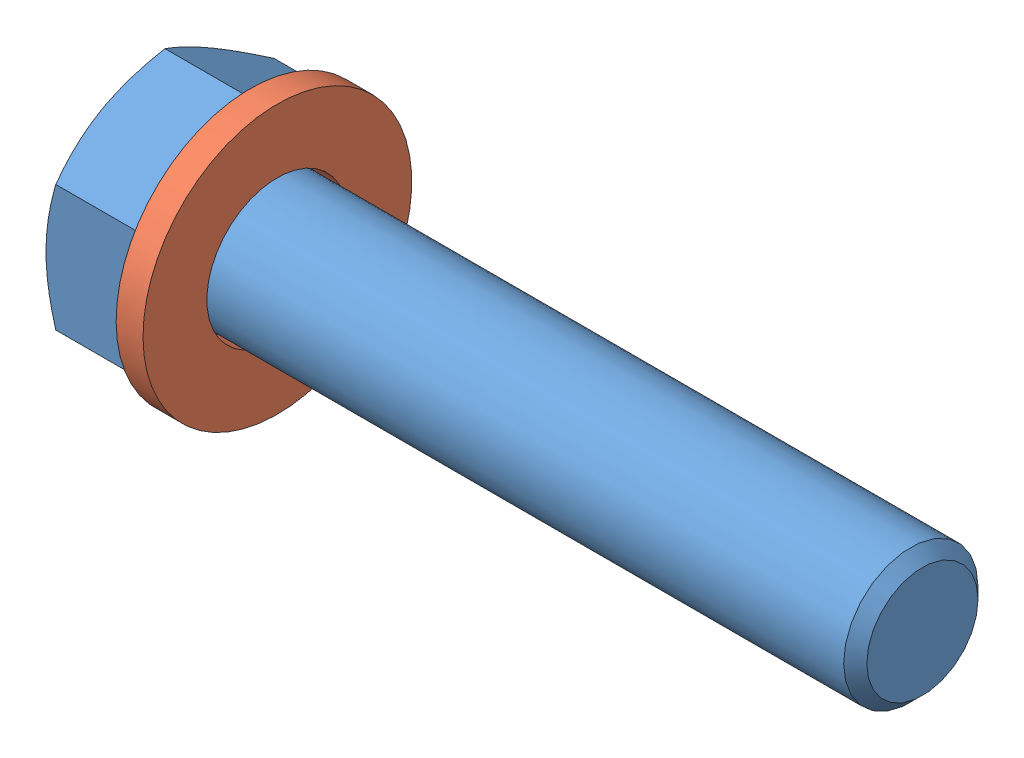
SolidWorks assembly Assemblage2.sldasm, configuration Défaut (file format 3400). Lengths in mm.
Overall size (45.67 20.9 20.9).
2 component instances, 2 part files, 2 mates.
Components (placement in the parent):
- Vis M8 40 mm-1: Vis M8 40 mm.SLDPRT [ISO 4018 - M8 x 40-NC] at (-25.9068 2.0315 0) size (45.67 15.01 13)
- Rondelle M8-1: Rondelle M8.SLDPRT [Washer ISO 7089 - 8] at (-20.2318 2.0315 0) x (-1 0 0) z (0 0.924225 0.381849) size (1.6 16 16)
Mates (geometry in assembly coordinates):
- Coaxiale11: concentric: cylinder of ?; cylinder of ?
- Coïncidente11: coincident anti-aligned: plane of ?; plane of ?
